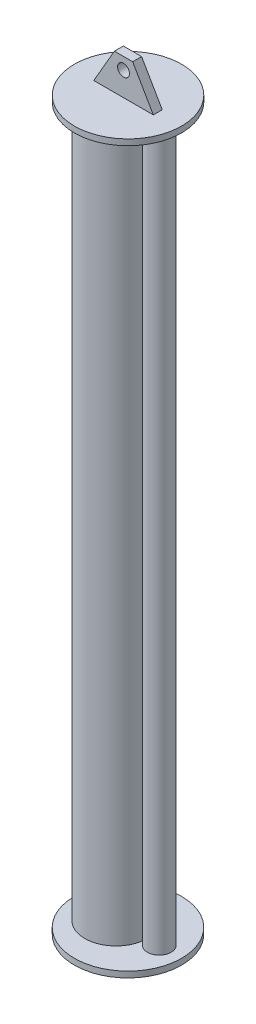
from build123d import *

# Parameters (mm, degrees)
SKETCH1_R           = 60.325
SKETCH1_R_2         = 19.05
BOSS_EXTRUDE1_DEPTH = 1524
SKETCH2_R           = 114.3
SKETCH2_R_2         = 12.7
SKETCH2_R_3         = 9.525
BOSS_EXTRUDE2_DEPTH = 12.7
BOSS_EXTRUDE3_START = 12.7
SKETCH3_R           = 114.3
BOSS_EXTRUDE3_DEPTH = 12.7
SKETCH4_R           = 12.7
BOSS_EXTRUDE4_DEPTH = 9.525


with BuildPart() as part:
    # Sketch1 → Boss-Extrude1 (new body)
    with BuildSketch(Plane(origin=(0, 0, 0), x_dir=(1, 0, 0), z_dir=(0, 1, 0))):
        with BuildLine():
            Line((-16.66911502, 6.972493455), (-15.327797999, 6.972493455))
            ThreePointArc((-15.327797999, 6.972493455), (34.496459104, 0), (-15.327797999, -6.972493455))
            Line((-15.327797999, -6.972493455), (-16.66911502, -6.972493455))
            ThreePointArc((-16.66911502, -6.972493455), (-149.653540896, 0), (-16.66911502, 6.972493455))
        make_face()
        with Locations(Location((-82.978540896, 0, 0), (0, 0, 270))):
            Circle(SKETCH1_R, mode=Mode.SUBTRACT)
        with Locations(Location((9.096459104, 0, 0), (0, 0, 270))):
            Circle(SKETCH1_R_2, mode=Mode.SUBTRACT)
    extrude(amount=BOSS_EXTRUDE1_DEPTH)

    # Sketch2 → Boss-Extrude2 (add)
    with BuildSketch(Plane.XZ):
        with Locations(Location((-57.578540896, 0, 0), (0, 0, 270))):
            Circle(SKETCH2_R)
        with Locations(Location((-82.978540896, 0, 0), (0, 0, 270))):
            Circle(SKETCH2_R_2, mode=Mode.SUBTRACT)
        with Locations(Location((9.096459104, 0, 0), (0, 0, 270))):
            Circle(SKETCH2_R_3, mode=Mode.SUBTRACT)
    extrude(amount=BOSS_EXTRUDE2_DEPTH)

    # Sketch3 → Boss-Extrude3 (add)
    with BuildSketch(Plane(origin=(0, 1524, 0), x_dir=(1, 0, 0), z_dir=(0, 1, 0)).offset(BOSS_EXTRUDE3_START)):
        with Locations(Location((-57.578540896, 0, 0), (0, 0, 90))):
            Circle(SKETCH3_R)
    extrude(amount=-BOSS_EXTRUDE3_DEPTH)

    # Sketch4 → Boss-Extrude4 (add, symmetric)
    with BuildSketch(Plane.XY):
        Polygon((5.921459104, 1536.7), (-121.078540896, 1536.7), (-77.084450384, 1612.9), (-38.072631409, 1612.9), align=None)
        with Locations(Location((-57.578540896, 1587.5, 0), (0, 0, 180))):
            Circle(SKETCH4_R, mode=Mode.SUBTRACT)
    extrude(amount=BOSS_EXTRUDE4_DEPTH, both=True)


solid = part.part
